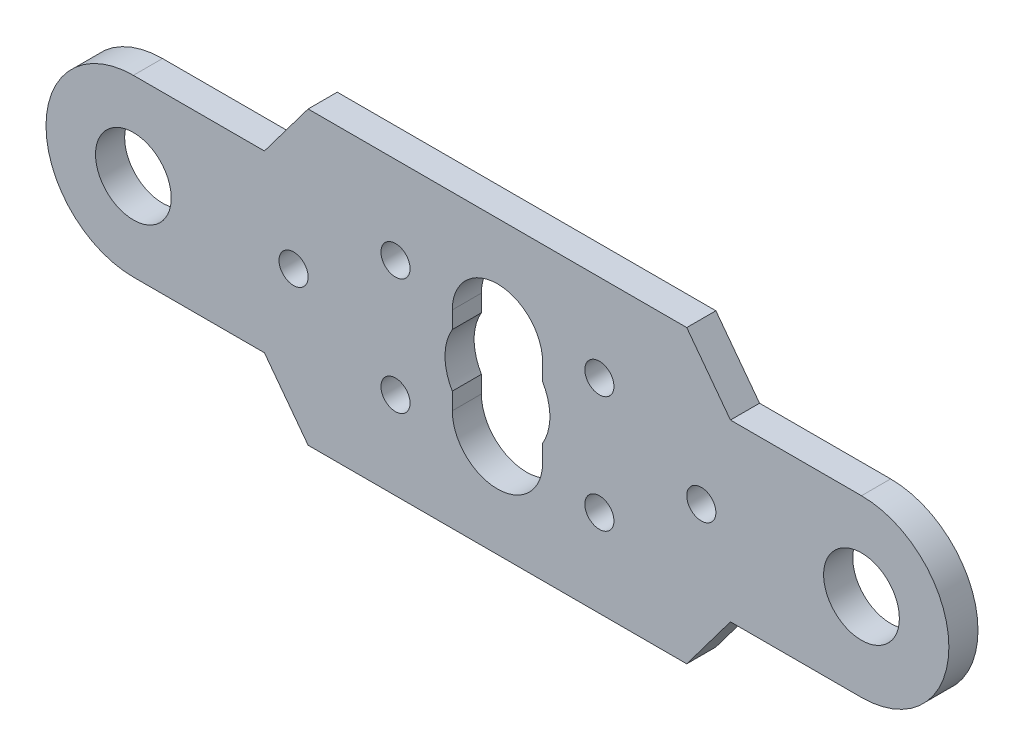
from build123d import *
from build123d.topology import SkipClean

# Parameters (mm, degrees)
EXTRUSION1_DEPTH = 1
ESQUISSE2_R      = 1.3
ESQUISSE2_R_2    = 0.5
EXTRUSION2_DEPTH = 17.317168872


with BuildPart() as part:
    # Esquisse1 → Extrusion1 (new body)
    with BuildSketch(Plane.XY):
        with BuildLine():
            Line((0, 0), (0, 5))
            Line((0, 5), (6.5, 5))
            Line((6.5, 5), (8, 3))
            Line((8, 3), (12.5, 3))
            ThreePointArc((12.5, 3), (14.621320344, 2.121320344), (15.5, 0))
            Line((15.5, 0), (0, 0))
        make_face()
    extrude(amount=EXTRUSION1_DEPTH)

    # Esquisse2 → Extrusion2 (cut, through all)
    with BuildSketch(Plane.XY.offset(1)):
        with Locations((12.5, 0)):
            Circle(ESQUISSE2_R)
        with Locations((7, 0)):
            Circle(ESQUISSE2_R_2)
        with Locations((3.5, 2)):
            Circle(ESQUISSE2_R_2)
        with BuildLine():
            Line((1.55, 1.5), (1.55, 0.915150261))
            ThreePointArc((1.55, 0.915150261), (-0.067756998, -1.798724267), (-1.476758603, 1.029166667))
            ThreePointArc((-1.476758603, 1.029166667), (-0.238247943, 3.031580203), (1.55, 1.5))
        make_face()
    extrude(amount=-EXTRUSION2_DEPTH, mode=Mode.SUBTRACT)

    # Sym_trie1: part across plane


with BuildPart() as part_1:
    with SkipClean():  # the faces are left unmerged after this step: merging them gives an invalid solid
        add(part.part)
        add(part.part.mirror(Plane(origin=(0, 0, 1), x_dir=(0, 0, 1), z_dir=(0, 1, 0))))

    # Sym_trie2: part across plane


with BuildPart() as part_2:
    with SkipClean():  # the faces are left unmerged after this step: merging them gives an invalid solid
        add(part_1.part)
        add(part_1.part.mirror(Plane(origin=(0, 0, 1), x_dir=(0, 0, 1), z_dir=(1, 0, 0))))


solid = part_2.part
